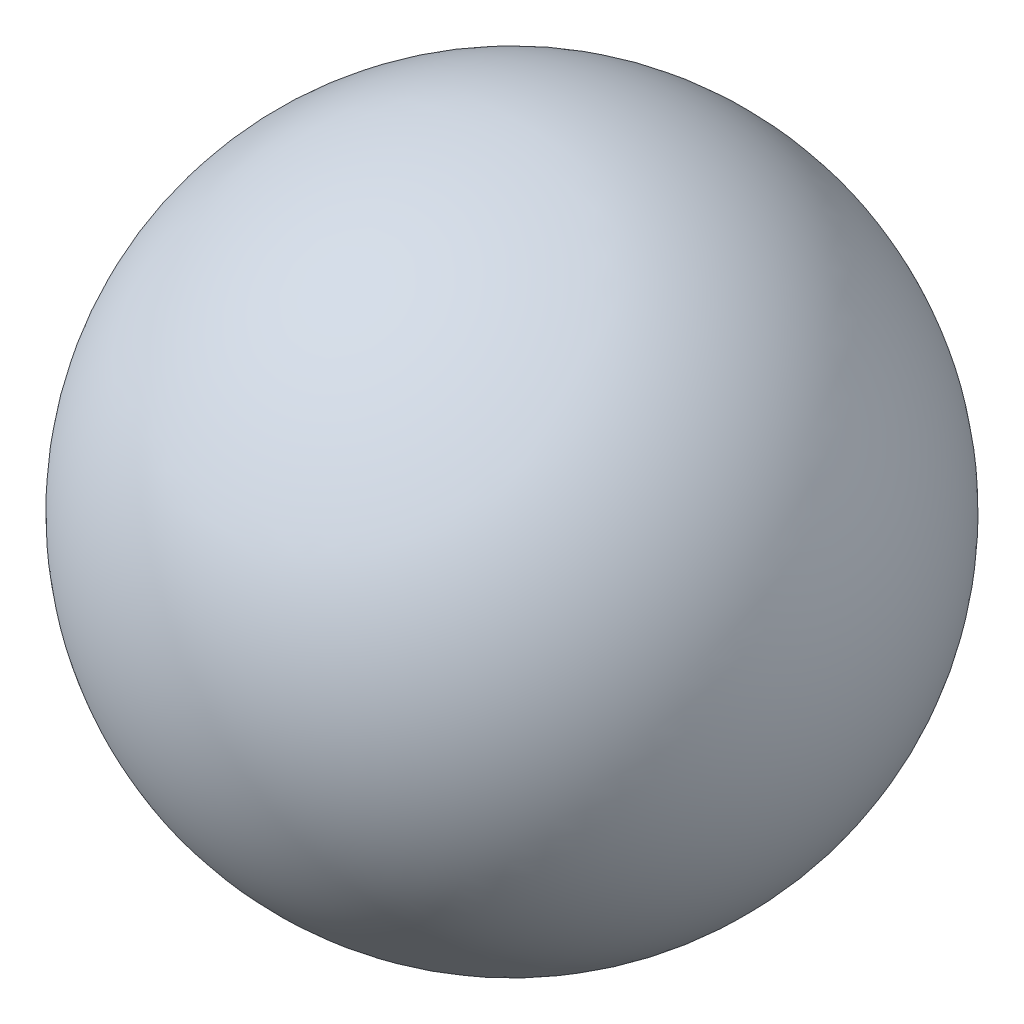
from build123d import *


with BuildPart() as part:
    # Sketch1 → Revolve4 (revolve)
    with BuildSketch(Plane(origin=(0, 0, 0), x_dir=(1, 0, 0), z_dir=(0, 1, 0))):
        with BuildLine():
            Line((0, -1.5875), (0, 1.5875))
            ThreePointArc((0, 1.5875), (-1.5875, 0), (0, -1.5875))
        make_face()
    revolve(axis=Axis((0, 0, -1.331789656), (0, 0, 1)))


solid = part.part
